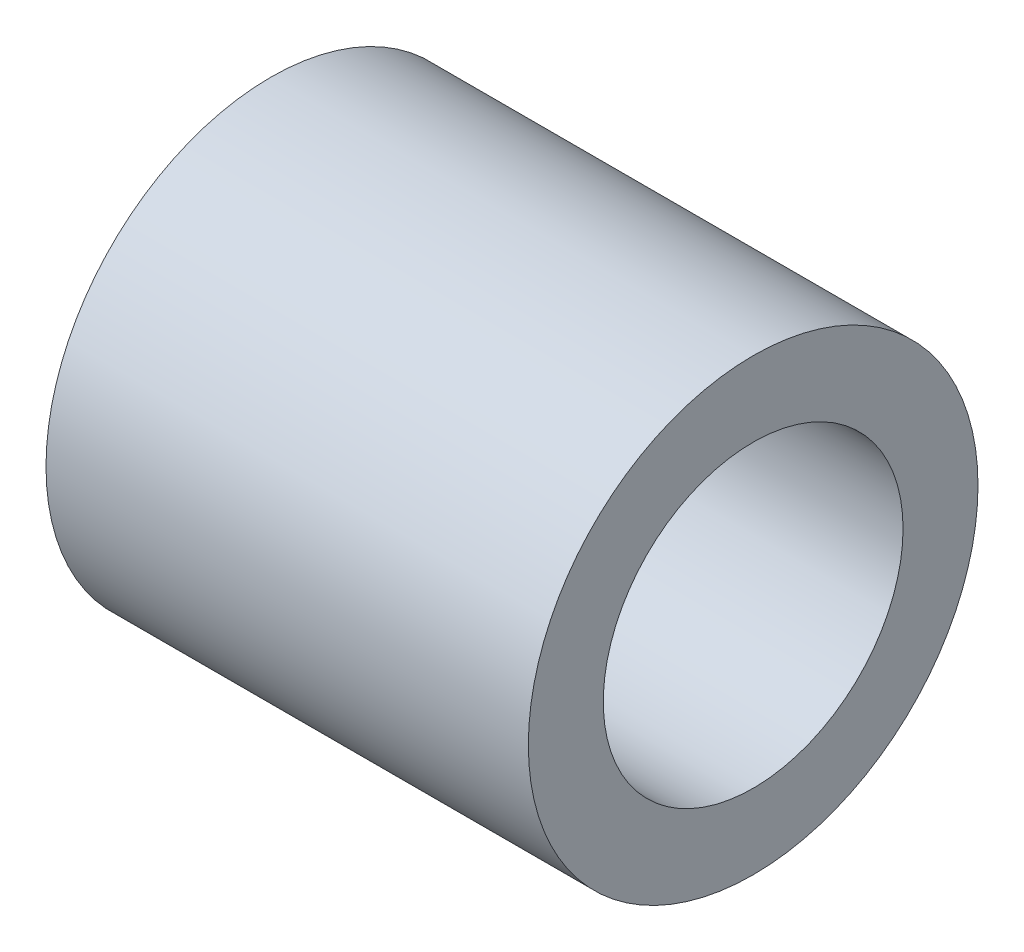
from build123d import *

# Parameters (mm, degrees)
SKETCH1_R           = 38.1
SKETCH1_R_2         = 25.4
EXTRUDE_THIN1_DEPTH = 40.8686


with BuildPart() as part:
    # Sketch1 → Extrude-Thin1 (new, symmetric)
    with BuildSketch(Plane(origin=(0, 0, 0), x_dir=(0, 0, -1), z_dir=(1, 0, 0))):
        Circle(SKETCH1_R)
        Circle(SKETCH1_R_2, mode=Mode.SUBTRACT)
    extrude(amount=EXTRUDE_THIN1_DEPTH, both=True)


solid = part.part
